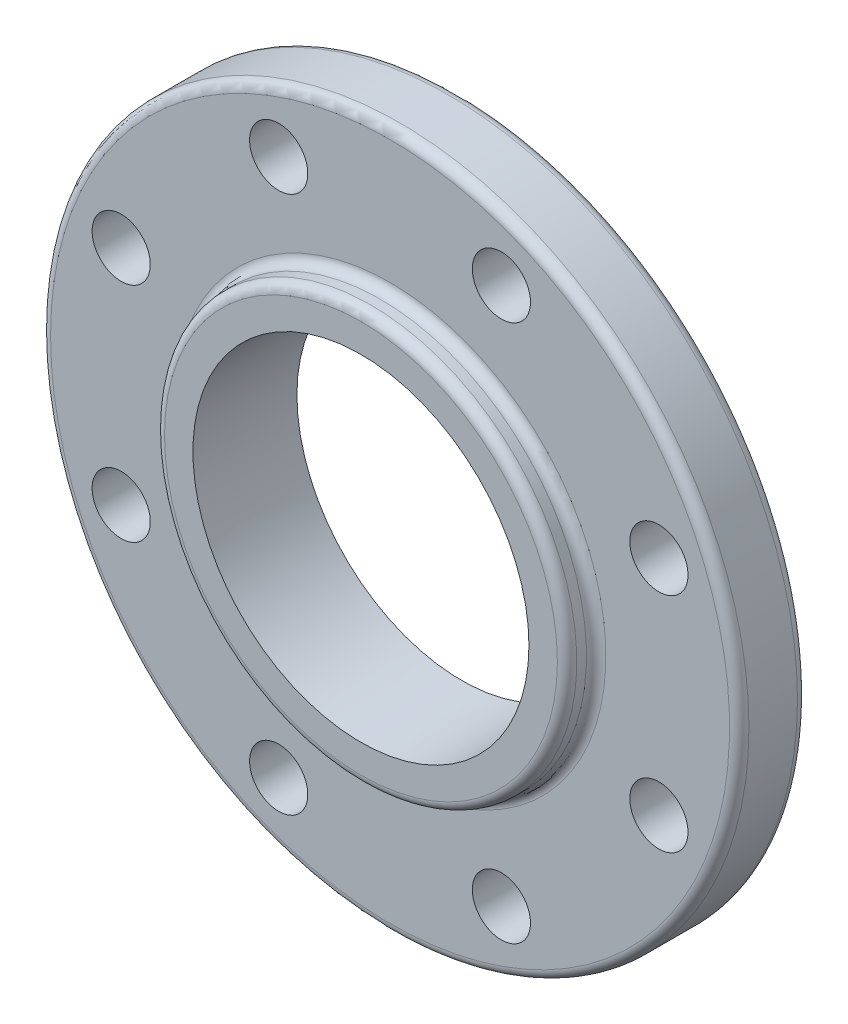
from build123d import *

# Parameters (mm, degrees)
SKETCH2_R          = 9.525
CUT_EXTRUDE1_DEPTH = 22.225
CIRPATTERN1_COUNT  = 8


with BuildPart() as part:
    # Sketch1 → Base-Revolve (revolve)
    with BuildSketch(Plane(origin=(0, 0, 0), x_dir=(1, 0, 0), z_dir=(0, 1, 0)), mode=Mode.PRIVATE) as base_revolve_sk:
        with BuildLine():
            Line((0, -33.3375), (0, 0))
            Line((0, 0), (78.58125, 0))
            Line((78.58125, 0), (78.58125, -0.0635))
            ThreePointArc((78.58125, -0.0635), (79.027619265, -1.141130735), (80.10525, -1.5875))
            Line((80.10525, -1.5875), (111.125, -1.5875))
            ThreePointArc((111.125, -1.5875), (113.37006403, -2.51743597), (114.3, -4.7625))
            Line((114.3, -4.7625), (114.3, -20.6375))
            ThreePointArc((114.3, -20.6375), (113.37006403, -22.88256403), (111.125, -23.8125))
            Line((111.125, -23.8125), (70.64375, -23.8125))
            ThreePointArc((70.64375, -23.8125), (68.39868597, -24.74243597), (67.46875, -26.9875))
            Line((67.46875, -26.9875), (67.46875, -30.1625))
            ThreePointArc((67.46875, -30.1625), (66.53881403, -32.40756403), (64.29375, -33.3375))
            Line((64.29375, -33.3375), (0, -33.3375))
        make_face()
    revolve(base_revolve_sk.sketch.rotate(Axis((0, 0, -31.212238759), (0, 0, 1)), 180), axis=Axis((0, 0, -31.212238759), (0, 0, 1)))

    # Sketch2 → Cut-Extrude1 (cut)
    with BuildSketch(Plane(origin=(0, 0, 1.5875), x_dir=(-1, 0, 0), z_dir=(0, 0, -1))):
        with Locations((36.450596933, 87.999525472)):
            Circle(SKETCH2_R)
    cut_extrude1 = extrude(amount=-CUT_EXTRUDE1_DEPTH, mode=Mode.SUBTRACT)

    # CirPattern1: Cut-Extrude1 ×8 about axis
    cirpattern1_axis = Axis((0, 0, -31.212238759), (0, 0, 1))
    for i in range(1, CIRPATTERN1_COUNT):
        add(cut_extrude1.rotate(cirpattern1_axis, i * 360 / CIRPATTERN1_COUNT), mode=Mode.SUBTRACT)

    # Sketch22 → 4 NPT Tapped Hole1 (revolve, cut)
    with BuildSketch(Plane(origin=(0, 0, 33.3375), x_dir=(0, -1, 0), z_dir=(1, 0, 0))):
        Polygon((0, 0), (0, 33.3375), (55.5625, 33.3375), (55.5625, 33.02), (53.982147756, 33.02), (54.991, 0), align=None)
    revolve(axis=Axis((0, 0, 39.6875), (0, 0, -1)), mode=Mode.SUBTRACT)


solid = part.part
